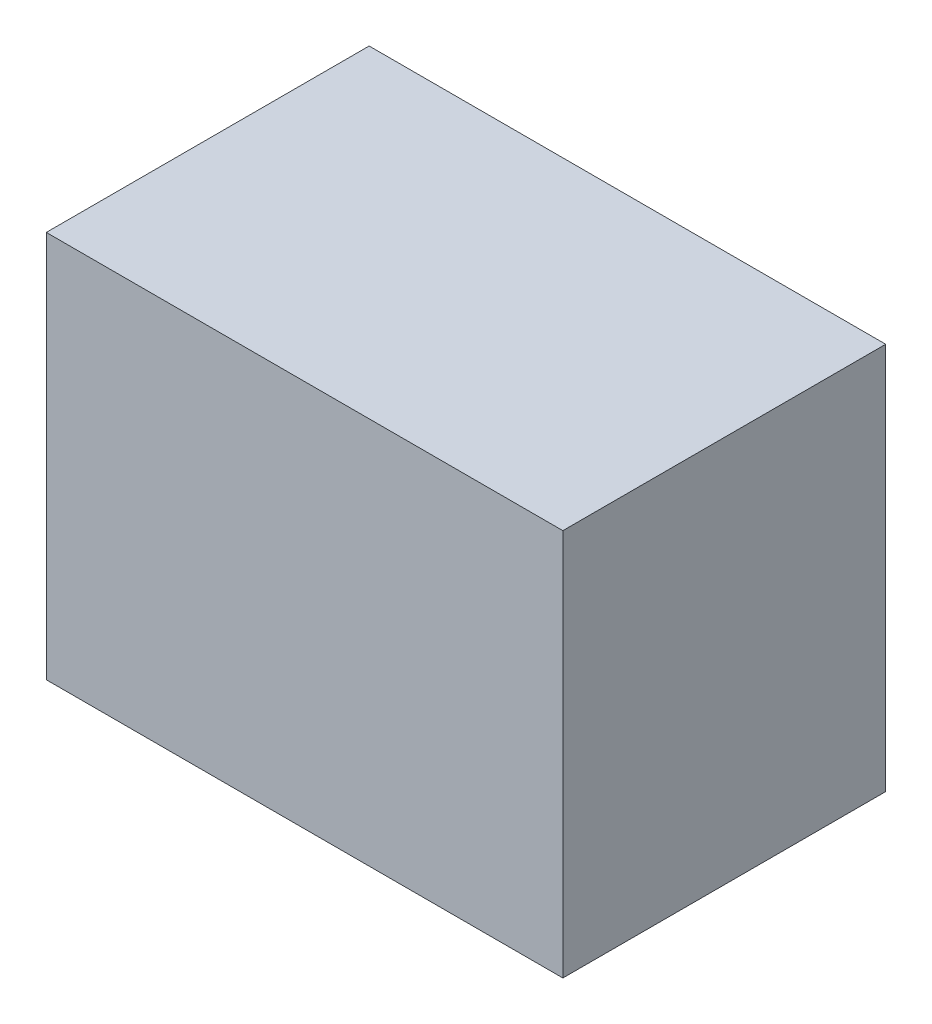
ISO-10303-21;
HEADER;
FILE_DESCRIPTION(('STEP AP214'),'2;1');
FILE_NAME('part.step','',(''),(''),'','','');
FILE_SCHEMA(('AUTOMOTIVE_DESIGN { 1 0 10303 214 1 1 1 1 }'));
ENDSEC;
DATA;
#1=APPLICATION_CONTEXT('core data for automotive mechanical design processes');
#2=APPLICATION_PROTOCOL_DEFINITION('international standard','automotive_design',2000,#1);
#3=PRODUCT_CONTEXT('',#1,'mechanical');
#4=PRODUCT('Part','Part','',(#3));
#5=PRODUCT_RELATED_PRODUCT_CATEGORY('part','',(#4));
#6=PRODUCT_DEFINITION_FORMATION('','',#4);
#7=PRODUCT_DEFINITION_CONTEXT('part definition',#1,'design');
#8=PRODUCT_DEFINITION('design','',#6,#7);
#9=PRODUCT_DEFINITION_SHAPE('','',#8);
#10=(LENGTH_UNIT() NAMED_UNIT(*) SI_UNIT(.MILLI.,.METRE.));
#11=(NAMED_UNIT(*) PLANE_ANGLE_UNIT() SI_UNIT($,.RADIAN.));
#12=(NAMED_UNIT(*) SI_UNIT($,.STERADIAN.) SOLID_ANGLE_UNIT());
#13=UNCERTAINTY_MEASURE_WITH_UNIT(LENGTH_MEASURE(1.E-05),#10,'distance_accuracy_value','');
#14=(GEOMETRIC_REPRESENTATION_CONTEXT(3) GLOBAL_UNCERTAINTY_ASSIGNED_CONTEXT((#13)) GLOBAL_UNIT_ASSIGNED_CONTEXT((#10,
#11,#12)) REPRESENTATION_CONTEXT('',''));
#15=CARTESIAN_POINT('',(0.,0.,0.));
#16=DIRECTION('',(0.,0.,1.));
#17=DIRECTION('',(1.,0.,0.));
#18=AXIS2_PLACEMENT_3D('',#15,#16,#17);
#19=CARTESIAN_POINT('',(-97.5303477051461,77.7892840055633,127.));
#20=DIRECTION('',(1.,0.,0.));
#21=DIRECTION('',(0.,1.,0.));
#22=AXIS2_PLACEMENT_3D('',#19,#20,#21);
#23=PLANE('',#22);
#24=DIRECTION('',(0.,-1.,0.));
#25=VECTOR('',#24,1.);
#26=CARTESIAN_POINT('',(-97.5303477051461,77.7892840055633,0.));
#27=LINE('',#26,#25);
#28=CARTESIAN_POINT('',(-97.5303477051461,77.7892840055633,0.));
#29=VERTEX_POINT('',#28);
#30=CARTESIAN_POINT('',(-97.530347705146,-74.6107159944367,0.));
#31=VERTEX_POINT('',#30);
#32=EDGE_CURVE('E94',#29,#31,#27,.T.);
#33=ORIENTED_EDGE('',*,*,#32,.T.);
#34=DIRECTION('',(0.,0.,-1.));
#35=VECTOR('',#34,1.);
#36=CARTESIAN_POINT('',(-97.530347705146,-74.6107159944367,127.));
#37=LINE('',#36,#35);
#38=CARTESIAN_POINT('',(-97.530347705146,-74.6107159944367,127.));
#39=VERTEX_POINT('',#38);
#40=EDGE_CURVE('E11',#39,#31,#37,.T.);
#41=ORIENTED_EDGE('',*,*,#40,.F.);
#42=DIRECTION('',(0.,-1.,0.));
#43=VECTOR('',#42,1.);
#44=CARTESIAN_POINT('',(-97.5303477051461,77.7892840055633,127.));
#45=LINE('',#44,#43);
#46=CARTESIAN_POINT('',(-97.5303477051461,77.7892840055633,127.));
#47=VERTEX_POINT('',#46);
#48=EDGE_CURVE('E82',#47,#39,#45,.T.);
#49=ORIENTED_EDGE('',*,*,#48,.F.);
#50=DIRECTION('',(0.,0.,-1.));
#51=VECTOR('',#50,1.);
#52=CARTESIAN_POINT('',(-97.5303477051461,77.7892840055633,127.));
#53=LINE('',#52,#51);
#54=EDGE_CURVE('E90',#47,#29,#53,.T.);
#55=ORIENTED_EDGE('',*,*,#54,.T.);
#56=EDGE_LOOP('',(#33,#41,#49,#55));
#57=FACE_BOUND('',#56,.T.);
#58=ADVANCED_FACE('F31',(#57),#23,.F.);
#59=CARTESIAN_POINT('',(-97.530347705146,-74.6107159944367,127.));
#60=DIRECTION('',(0.,1.,0.));
#61=DIRECTION('',(0.,0.,1.));
#62=AXIS2_PLACEMENT_3D('',#59,#60,#61);
#63=PLANE('',#62);
#64=DIRECTION('',(1.,0.,0.));
#65=VECTOR('',#64,1.);
#66=CARTESIAN_POINT('',(-97.530347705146,-74.6107159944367,0.));
#67=LINE('',#66,#65);
#68=CARTESIAN_POINT('',(105.669652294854,-74.6107159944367,0.));
#69=VERTEX_POINT('',#68);
#70=EDGE_CURVE('E86',#31,#69,#67,.T.);
#71=ORIENTED_EDGE('',*,*,#70,.T.);
#72=DIRECTION('',(0.,0.,-1.));
#73=VECTOR('',#72,1.);
#74=CARTESIAN_POINT('',(105.669652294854,-74.6107159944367,127.));
#75=LINE('',#74,#73);
#76=CARTESIAN_POINT('',(105.669652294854,-74.6107159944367,127.));
#77=VERTEX_POINT('',#76);
#78=EDGE_CURVE('E39',#77,#69,#75,.T.);
#79=ORIENTED_EDGE('',*,*,#78,.F.);
#80=DIRECTION('',(1.,0.,0.));
#81=VECTOR('',#80,1.);
#82=CARTESIAN_POINT('',(-97.530347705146,-74.6107159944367,127.));
#83=LINE('',#82,#81);
#84=EDGE_CURVE('E77',#39,#77,#83,.T.);
#85=ORIENTED_EDGE('',*,*,#84,.F.);
#86=ORIENTED_EDGE('',*,*,#40,.T.);
#87=EDGE_LOOP('',(#71,#79,#85,#86));
#88=FACE_BOUND('',#87,.T.);
#89=ADVANCED_FACE('F85',(#88),#63,.F.);
#90=CARTESIAN_POINT('',(105.669652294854,77.7892840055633,127.));
#91=DIRECTION('',(-1.,0.,0.));
#92=DIRECTION('',(0.,-1.,0.));
#93=AXIS2_PLACEMENT_3D('',#90,#91,#92);
#94=PLANE('',#93);
#95=DIRECTION('',(0.,1.,0.));
#96=VECTOR('',#95,1.);
#97=CARTESIAN_POINT('',(105.669652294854,77.7892840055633,0.));
#98=LINE('',#97,#96);
#99=CARTESIAN_POINT('',(105.669652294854,77.7892840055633,0.));
#100=VERTEX_POINT('',#99);
#101=EDGE_CURVE('E64',#69,#100,#98,.T.);
#102=ORIENTED_EDGE('',*,*,#101,.T.);
#103=DIRECTION('',(0.,0.,-1.));
#104=VECTOR('',#103,1.);
#105=CARTESIAN_POINT('',(105.669652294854,77.7892840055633,127.));
#106=LINE('',#105,#104);
#107=CARTESIAN_POINT('',(105.669652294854,77.7892840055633,127.));
#108=VERTEX_POINT('',#107);
#109=EDGE_CURVE('E87',#108,#100,#106,.T.);
#110=ORIENTED_EDGE('',*,*,#109,.F.);
#111=DIRECTION('',(0.,1.,0.));
#112=VECTOR('',#111,1.);
#113=CARTESIAN_POINT('',(105.669652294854,77.7892840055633,127.));
#114=LINE('',#113,#112);
#115=EDGE_CURVE('E80',#77,#108,#114,.T.);
#116=ORIENTED_EDGE('',*,*,#115,.F.);
#117=ORIENTED_EDGE('',*,*,#78,.T.);
#118=EDGE_LOOP('',(#102,#110,#116,#117));
#119=FACE_BOUND('',#118,.T.);
#120=ADVANCED_FACE('F88',(#119),#94,.F.);
#121=CARTESIAN_POINT('',(-97.5303477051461,77.7892840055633,127.));
#122=DIRECTION('',(0.,-1.,0.));
#123=DIRECTION('',(0.,0.,-1.));
#124=AXIS2_PLACEMENT_3D('',#121,#122,#123);
#125=PLANE('',#124);
#126=DIRECTION('',(-1.,0.,0.));
#127=VECTOR('',#126,1.);
#128=CARTESIAN_POINT('',(-97.5303477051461,77.7892840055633,0.));
#129=LINE('',#128,#127);
#130=EDGE_CURVE('E70',#100,#29,#129,.T.);
#131=ORIENTED_EDGE('',*,*,#130,.T.);
#132=ORIENTED_EDGE('',*,*,#54,.F.);
#133=DIRECTION('',(-1.,0.,0.));
#134=VECTOR('',#133,1.);
#135=CARTESIAN_POINT('',(-97.5303477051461,77.7892840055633,127.));
#136=LINE('',#135,#134);
#137=EDGE_CURVE('E47',#108,#47,#136,.T.);
#138=ORIENTED_EDGE('',*,*,#137,.F.);
#139=ORIENTED_EDGE('',*,*,#109,.T.);
#140=EDGE_LOOP('',(#131,#132,#138,#139));
#141=FACE_BOUND('',#140,.T.);
#142=ADVANCED_FACE('F101',(#141),#125,.F.);
#143=CARTESIAN_POINT('',(-97.530347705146,-74.6107159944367,127.));
#144=DIRECTION('',(0.,0.,1.));
#145=DIRECTION('',(1.,0.,0.));
#146=AXIS2_PLACEMENT_3D('',#143,#144,#145);
#147=PLANE('',#146);
#148=ORIENTED_EDGE('',*,*,#48,.T.);
#149=ORIENTED_EDGE('',*,*,#84,.T.);
#150=ORIENTED_EDGE('',*,*,#115,.T.);
#151=ORIENTED_EDGE('',*,*,#137,.T.);
#152=EDGE_LOOP('',(#148,#149,#150,#151));
#153=FACE_BOUND('',#152,.T.);
#154=ADVANCED_FACE('F78',(#153),#147,.T.);
#155=CARTESIAN_POINT('',(-97.530347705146,-74.6107159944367,0.));
#156=DIRECTION('',(0.,0.,1.));
#157=DIRECTION('',(1.,0.,0.));
#158=AXIS2_PLACEMENT_3D('',#155,#156,#157);
#159=PLANE('',#158);
#160=ORIENTED_EDGE('',*,*,#32,.F.);
#161=ORIENTED_EDGE('',*,*,#130,.F.);
#162=ORIENTED_EDGE('',*,*,#101,.F.);
#163=ORIENTED_EDGE('',*,*,#70,.F.);
#164=EDGE_LOOP('',(#160,#161,#162,#163));
#165=FACE_BOUND('',#164,.T.);
#166=ADVANCED_FACE('F104',(#165),#159,.F.);
#167=CLOSED_SHELL('',(#58,#89,#120,#142,#154,#166));
#168=MANIFOLD_SOLID_BREP('B2',#167);
#169=ADVANCED_BREP_SHAPE_REPRESENTATION('',(#18,#168),#14);
#170=SHAPE_DEFINITION_REPRESENTATION(#9,#169);
ENDSEC;
END-ISO-10303-21;
